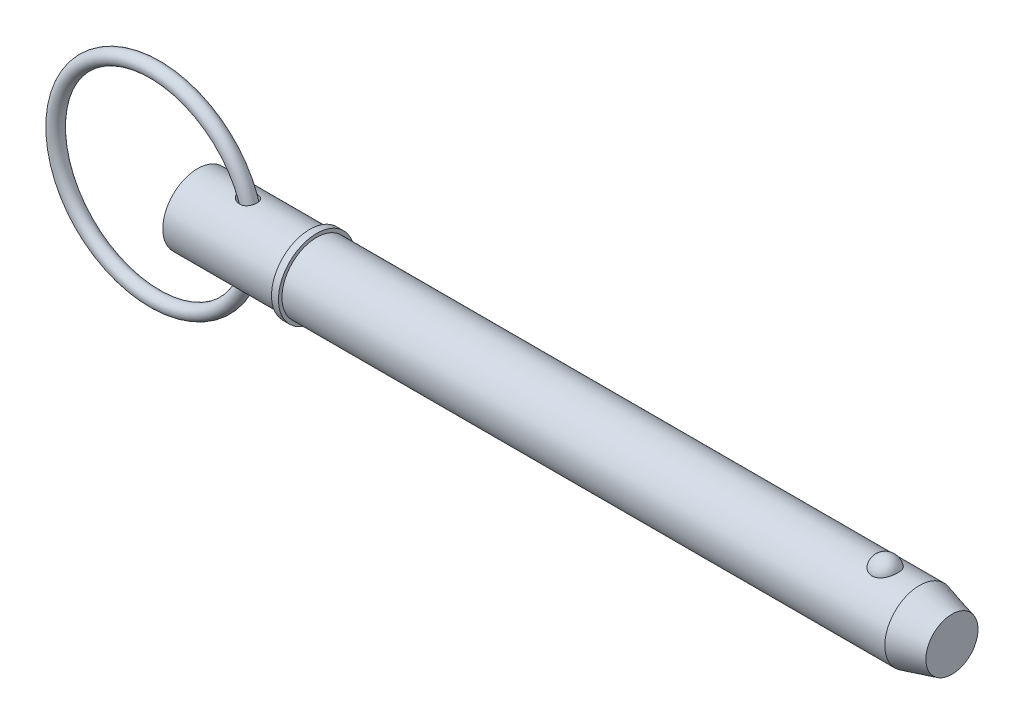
ISO-10303-21;
HEADER;
FILE_DESCRIPTION(('STEP AP214'),'2;1');
FILE_NAME('part.step','',(''),(''),'','','');
FILE_SCHEMA(('AUTOMOTIVE_DESIGN { 1 0 10303 214 1 1 1 1 }'));
ENDSEC;
DATA;
#1=APPLICATION_CONTEXT('core data for automotive mechanical design processes');
#2=APPLICATION_PROTOCOL_DEFINITION('international standard','automotive_design',2000,#1);
#3=PRODUCT_CONTEXT('',#1,'mechanical');
#4=PRODUCT('Part','Part','',(#3));
#5=PRODUCT_RELATED_PRODUCT_CATEGORY('part','',(#4));
#6=PRODUCT_DEFINITION_FORMATION('','',#4);
#7=PRODUCT_DEFINITION_CONTEXT('part definition',#1,'design');
#8=PRODUCT_DEFINITION('design','',#6,#7);
#9=PRODUCT_DEFINITION_SHAPE('','',#8);
#10=(LENGTH_UNIT() NAMED_UNIT(*) SI_UNIT(.MILLI.,.METRE.));
#11=(NAMED_UNIT(*) PLANE_ANGLE_UNIT() SI_UNIT($,.RADIAN.));
#12=(NAMED_UNIT(*) SI_UNIT($,.STERADIAN.) SOLID_ANGLE_UNIT());
#13=UNCERTAINTY_MEASURE_WITH_UNIT(LENGTH_MEASURE(1.E-05),#10,'distance_accuracy_value','');
#14=(GEOMETRIC_REPRESENTATION_CONTEXT(3) GLOBAL_UNCERTAINTY_ASSIGNED_CONTEXT((#13)) GLOBAL_UNIT_ASSIGNED_CONTEXT((#10,
#11,#12)) REPRESENTATION_CONTEXT('',''));
#15=CARTESIAN_POINT('',(0.,0.,0.));
#16=DIRECTION('',(0.,0.,1.));
#17=DIRECTION('',(1.,0.,0.));
#18=AXIS2_PLACEMENT_3D('',#15,#16,#17);
#19=CARTESIAN_POINT('',(-13.640845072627,0.,0.));
#20=DIRECTION('',(0.,0.,1.));
#21=DIRECTION('',(1.,0.,0.));
#22=AXIS2_PLACEMENT_3D('',#19,#20,#21);
#23=TOROIDAL_SURFACE('',#22,31.75,2.223);
#24=CARTESIAN_POINT('',(20.332154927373,0.,0.));
#25=VERTEX_POINT('',#24);
#26=VERTEX_LOOP('',#25);
#27=FACE_BOUND('',#26,.T.);
#28=ADVANCED_FACE('P0_F12',(#27),#23,.T.);
#29=CLOSED_SHELL('',(#28));
#30=MANIFOLD_SOLID_BREP('P0_B1',#29);
#31=CARTESIAN_POINT('',(0.,0.,0.));
#32=DIRECTION('',(1.,0.,0.));
#33=DIRECTION('',(0.,0.,-1.));
#34=AXIS2_PLACEMENT_3D('',#31,#32,#33);
#35=CYLINDRICAL_SURFACE('',#34,11.115);
#36=CARTESIAN_POINT('',(13.5245830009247,11.0328953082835,-1.34849772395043));
#37=CARTESIAN_POINT('',(13.6190616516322,11.0150940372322,-1.49413162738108));
#38=CARTESIAN_POINT('',(13.7272589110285,10.9954577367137,-1.63076546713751));
#39=CARTESIAN_POINT('',(13.9654537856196,10.9550099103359,-1.8834727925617));
#40=CARTESIAN_POINT('',(14.0954990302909,10.9341958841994,-1.99950019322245));
#41=CARTESIAN_POINT('',(14.3718600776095,10.893854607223,-2.20871939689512));
#42=CARTESIAN_POINT('',(14.5180879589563,10.8743212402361,-2.30202655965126));
#43=CARTESIAN_POINT('',(14.8233821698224,10.8385071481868,-2.46515115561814));
#44=CARTESIAN_POINT('',(14.9824448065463,10.8222254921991,-2.53497531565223));
#45=CARTESIAN_POINT('',(15.3233581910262,10.7936101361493,-2.65430007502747));
#46=CARTESIAN_POINT('',(15.5060064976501,10.7817126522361,-2.7016502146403));
#47=CARTESIAN_POINT('',(15.8771124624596,10.7657570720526,-2.76455948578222));
#48=CARTESIAN_POINT('',(16.0655695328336,10.7616981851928,-2.78012182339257));
#49=CARTESIAN_POINT('',(16.4345152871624,10.7624400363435,-2.77724928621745));
#50=CARTESIAN_POINT('',(16.6150121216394,10.7668823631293,-2.76018977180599));
#51=CARTESIAN_POINT('',(16.9695132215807,10.7837407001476,-2.69357457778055));
#52=CARTESIAN_POINT('',(17.1435222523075,10.7961507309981,-2.64404326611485));
#53=CARTESIAN_POINT('',(17.4621418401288,10.8258984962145,-2.51928348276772));
#54=CARTESIAN_POINT('',(17.6079677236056,10.8426430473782,-2.44700611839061));
#55=CARTESIAN_POINT('',(17.884162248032,10.8794194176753,-2.27791740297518));
#56=CARTESIAN_POINT('',(18.0145349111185,10.8994503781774,-2.18111245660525));
#57=CARTESIAN_POINT('',(18.2494965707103,10.9392822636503,-1.9713196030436));
#58=CARTESIAN_POINT('',(18.3550661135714,10.9590421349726,-1.85941863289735));
#59=CARTESIAN_POINT('',(18.5458147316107,10.9970986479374,-1.61919918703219));
#60=CARTESIAN_POINT('',(18.6309947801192,11.0153953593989,-1.49088149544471));
#61=CARTESIAN_POINT('',(18.7786686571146,11.0484675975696,-1.2218388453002));
#62=CARTESIAN_POINT('',(18.8412214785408,11.063252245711,-1.08114735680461));
#63=CARTESIAN_POINT('',(18.9425265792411,11.0877718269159,-0.791025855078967));
#64=CARTESIAN_POINT('',(18.9812780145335,11.0975065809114,-0.641595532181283));
#65=CARTESIAN_POINT('',(19.0343305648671,11.1109435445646,-0.336997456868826));
#66=CARTESIAN_POINT('',(19.0484404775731,11.1145985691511,-0.181794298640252));
#67=CARTESIAN_POINT('',(19.0513147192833,11.1153384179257,0.128864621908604));
#68=CARTESIAN_POINT('',(19.0400783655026,11.112423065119,0.284320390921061));
#69=CARTESIAN_POINT('',(18.9924362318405,11.1003163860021,0.591525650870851));
#70=CARTESIAN_POINT('',(18.9559600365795,11.0911075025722,0.743263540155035));
#71=CARTESIAN_POINT('',(18.858576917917,11.0673920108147,1.0382524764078));
#72=CARTESIAN_POINT('',(18.7976699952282,11.0528854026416,1.18150352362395));
#73=CARTESIAN_POINT('',(18.6529960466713,11.020201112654,1.45511394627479));
#74=CARTESIAN_POINT('',(18.5692772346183,11.0020311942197,1.58549973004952));
#75=CARTESIAN_POINT('',(18.3810003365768,10.9640237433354,1.82995492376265));
#76=CARTESIAN_POINT('',(18.2764441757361,10.9441863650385,1.94402583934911));
#77=CARTESIAN_POINT('',(18.0501398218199,10.9052267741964,2.15183128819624));
#78=CARTESIAN_POINT('',(17.9285270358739,10.8861003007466,2.24571250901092));
#79=CARTESIAN_POINT('',(17.6709592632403,10.8505244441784,2.41175942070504));
#80=CARTESIAN_POINT('',(17.5350055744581,10.8340748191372,2.48392707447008));
#81=CARTESIAN_POINT('',(17.2528390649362,10.8056099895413,2.60497667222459));
#82=CARTESIAN_POINT('',(17.1066353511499,10.7935909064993,2.65387899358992));
#83=CARTESIAN_POINT('',(16.8080326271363,10.7750969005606,2.72799859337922));
#84=CARTESIAN_POINT('',(16.6556326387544,10.7686228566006,2.75321211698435));
#85=CARTESIAN_POINT('',(16.3428877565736,10.761517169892,2.78086153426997));
#86=CARTESIAN_POINT('',(16.1824599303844,10.7611149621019,2.78240297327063));
#87=CARTESIAN_POINT('',(15.863296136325,10.766478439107,2.76156874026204));
#88=CARTESIAN_POINT('',(15.7045607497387,10.7722461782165,2.73918510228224));
#89=CARTESIAN_POINT('',(15.3787211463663,10.7898500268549,2.66904167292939));
#90=CARTESIAN_POINT('',(15.2120794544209,10.8021675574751,2.61925575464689));
#91=CARTESIAN_POINT('',(14.8886284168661,10.8315482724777,2.49496357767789));
#92=CARTESIAN_POINT('',(14.731827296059,10.8486153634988,2.42043695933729));
#93=CARTESIAN_POINT('',(14.4198762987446,10.8870804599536,2.24137362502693));
#94=CARTESIAN_POINT('',(14.2658484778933,10.9087148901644,2.13492229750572));
#95=CARTESIAN_POINT('',(13.9788214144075,10.9526299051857,1.89676517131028));
#96=CARTESIAN_POINT('',(13.8458041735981,10.9749099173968,1.76508120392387));
#97=CARTESIAN_POINT('',(13.6310853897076,11.012885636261,1.50762337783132));
#98=CARTESIAN_POINT('',(13.5444453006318,11.0290026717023,1.38602082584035));
#99=CARTESIAN_POINT('',(13.392158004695,11.0581740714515,1.12983363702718));
#100=CARTESIAN_POINT('',(13.3264946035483,11.0712307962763,0.995259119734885));
#101=CARTESIAN_POINT('',(13.2464179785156,11.0874250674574,0.785640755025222));
#102=CARTESIAN_POINT('',(13.2227369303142,11.0922707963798,0.714166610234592));
#103=CARTESIAN_POINT('',(13.1820656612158,11.1006486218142,0.569277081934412));
#104=CARTESIAN_POINT('',(13.1650721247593,11.1041813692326,0.495862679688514));
#105=CARTESIAN_POINT('',(13.1381118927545,11.1098070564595,0.347711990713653));
#106=CARTESIAN_POINT('',(13.1281436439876,11.1119003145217,0.272975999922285));
#107=CARTESIAN_POINT('',(13.1154243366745,11.1145746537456,0.122890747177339));
#108=CARTESIAN_POINT('',(13.1126723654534,11.1151559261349,0.0475415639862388));
#109=CARTESIAN_POINT('',(13.115160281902,11.1146296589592,-0.160384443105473));
#110=CARTESIAN_POINT('',(13.128061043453,11.111903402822,-0.292944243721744));
#111=CARTESIAN_POINT('',(13.175691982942,11.1019662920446,-0.553751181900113));
#112=CARTESIAN_POINT('',(13.2104121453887,11.094757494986,-0.682000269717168));
#113=CARTESIAN_POINT('',(13.2891255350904,11.0787645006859,-0.901873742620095));
#114=CARTESIAN_POINT('',(13.3290466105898,11.0707438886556,-0.995044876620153));
#115=CARTESIAN_POINT('',(13.4192915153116,11.0529876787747,-1.17599209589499));
#116=CARTESIAN_POINT('',(13.4696154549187,11.0432520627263,-1.26376812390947));
#117=CARTESIAN_POINT('',(13.5245830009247,11.0328953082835,-1.34849772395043));
#118=B_SPLINE_CURVE_WITH_KNOTS('',3,(#36,#37,#38,#39,#40,#41,#42,#43,#44,#45,#46,#47,#48,#49,
#50,#51,#52,#53,#54,#55,#56,#57,#58,#59,#60,#61,#62,#63,#64,#65,#66,#67,#68,#69,#70,#71,#72,#73,
#74,#75,#76,#77,#78,#79,#80,#81,#82,#83,#84,#85,#86,#87,#88,#89,#90,#91,#92,#93,#94,#95,#96,#97,
#98,#99,#100,#101,#102,#103,#104,#105,#106,#107,#108,#109,#110,#111,#112,#113,#114,#115,#116,
#117),.UNSPECIFIED.,.T.,.F.,(4,2,2,2,2,2,2,2,2,2,2,2,2,2,2,2,2,2,2,2,2,2,2,2,2,2,2,2,2,2,2,2,2,
2,2,2,2,2,2,2,4),(0.,0.52309976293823,1.04735506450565,1.56889024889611,2.09027590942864,
2.65465173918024,3.21897064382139,3.76002078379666,4.30066536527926,4.78898318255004,
5.27717362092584,5.74028268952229,6.20336964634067,6.665240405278,7.12712754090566,
7.59258295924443,8.05805091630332,8.52482272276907,8.99159451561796,9.45738731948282,
9.9231371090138,10.3853792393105,10.8475795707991,11.3093743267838,11.7712422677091,
12.2505208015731,12.7299589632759,13.2508366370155,13.7721440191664,14.334890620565,
14.8971525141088,15.3459336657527,15.7943675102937,16.0204422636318,16.2464047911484,
16.4723173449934,16.6982013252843,17.095711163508,17.4930386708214,17.7973741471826,
18.1017128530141),.UNSPECIFIED.);
#119=CARTESIAN_POINT('',(13.5245830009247,11.0328953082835,-1.34849772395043));
#120=VERTEX_POINT('',#119);
#121=EDGE_CURVE('P1_E42',#120,#120,#118,.T.);
#122=ORIENTED_EDGE('',*,*,#121,.T.);
#123=EDGE_LOOP('',(#122));
#124=FACE_BOUND('',#123,.T.);
#125=CARTESIAN_POINT('',(0.,0.,0.));
#126=DIRECTION('',(1.,0.,0.));
#127=DIRECTION('',(0.,0.,-1.));
#128=AXIS2_PLACEMENT_3D('',#125,#126,#127);
#129=CIRCLE('',#128,11.115);
#130=CARTESIAN_POINT('',(0.,0.,-11.115));
#131=VERTEX_POINT('',#130);
#132=EDGE_CURVE('P1_E9',#131,#131,#129,.T.);
#133=ORIENTED_EDGE('',*,*,#132,.T.);
#134=EDGE_LOOP('',(#133));
#135=FACE_BOUND('',#134,.T.);
#136=CARTESIAN_POINT('',(35.877,0.,0.));
#137=DIRECTION('',(1.,0.,0.));
#138=DIRECTION('',(0.,0.,-1.));
#139=AXIS2_PLACEMENT_3D('',#136,#137,#138);
#140=CIRCLE('',#139,11.115);
#141=CARTESIAN_POINT('',(35.877,0.,-11.115));
#142=VERTEX_POINT('',#141);
#143=EDGE_CURVE('P1_E25',#142,#142,#140,.T.);
#144=ORIENTED_EDGE('',*,*,#143,.F.);
#145=EDGE_LOOP('',(#144));
#146=FACE_BOUND('',#145,.T.);
#147=CARTESIAN_POINT('',(13.5245830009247,-11.0328953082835,-1.34849772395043));
#148=CARTESIAN_POINT('',(13.449887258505,-11.0469690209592,-1.233356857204));
#149=CARTESIAN_POINT('',(13.3837464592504,-11.0598986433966,-1.11255897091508));
#150=CARTESIAN_POINT('',(13.271526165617,-11.0822620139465,-0.861680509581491));
#151=CARTESIAN_POINT('',(13.2254273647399,-11.0916991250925,-0.731609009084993));
#152=CARTESIAN_POINT('',(13.1557497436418,-11.1060943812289,-0.464578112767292));
#153=CARTESIAN_POINT('',(13.1322820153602,-11.111030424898,-0.327588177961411));
#154=CARTESIAN_POINT('',(13.1098958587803,-11.1157368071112,-0.0515139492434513));
#155=CARTESIAN_POINT('',(13.1109730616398,-11.1155080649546,0.0875699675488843));
#156=CARTESIAN_POINT('',(13.1367722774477,-11.110088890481,0.354927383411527));
#157=CARTESIAN_POINT('',(13.160070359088,-11.1051972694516,0.483348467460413));
#158=CARTESIAN_POINT('',(13.2268311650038,-11.091413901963,0.734581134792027));
#159=CARTESIAN_POINT('',(13.2702981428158,-11.0825213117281,0.857391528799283));
#160=CARTESIAN_POINT('',(13.3769008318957,-11.0612491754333,1.09871322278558));
#161=CARTESIAN_POINT('',(13.4406446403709,-11.048763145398,1.21694419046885));
#162=CARTESIAN_POINT('',(13.5844860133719,-11.0215642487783,1.44267020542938));
#163=CARTESIAN_POINT('',(13.6645903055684,-11.0068504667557,1.55016080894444));
#164=CARTESIAN_POINT('',(13.8511803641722,-10.9741237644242,1.76795565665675));
#165=CARTESIAN_POINT('',(13.959808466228,-10.9559422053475,1.87639683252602));
#166=CARTESIAN_POINT('',(14.1916437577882,-10.9197998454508,2.07642617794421));
#167=CARTESIAN_POINT('',(14.3148607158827,-10.901839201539,2.16800294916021));
#168=CARTESIAN_POINT('',(14.5931107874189,-10.8649902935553,2.34622033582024));
#169=CARTESIAN_POINT('',(14.7501095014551,-10.8463937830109,2.42986679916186));
#170=CARTESIAN_POINT('',(15.0757118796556,-10.8136392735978,2.57171975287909));
#171=CARTESIAN_POINT('',(15.2443214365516,-10.7994835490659,2.62991321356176));
#172=CARTESIAN_POINT('',(15.599068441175,-10.7767894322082,2.72147498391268));
#173=CARTESIAN_POINT('',(15.7856559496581,-10.768622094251,2.75321798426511));
#174=CARTESIAN_POINT('',(16.1617095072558,-10.7608206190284,2.78356776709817));
#175=CARTESIAN_POINT('',(16.3511739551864,-10.7611818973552,2.78219235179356));
#176=CARTESIAN_POINT('',(16.7138126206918,-10.7705428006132,2.7457129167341));
#177=CARTESIAN_POINT('',(16.8872269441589,-10.7789612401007,2.71287798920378));
#178=CARTESIAN_POINT('',(17.2247245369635,-10.8028011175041,2.61632772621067));
#179=CARTESIAN_POINT('',(17.3888134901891,-10.8182182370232,2.55263143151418));
#180=CARTESIAN_POINT('',(17.6871641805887,-10.8524191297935,2.40281428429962));
#181=CARTESIAN_POINT('',(17.8227812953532,-10.8707652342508,2.31928155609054));
#182=CARTESIAN_POINT('',(18.0770765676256,-10.9094513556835,2.12988301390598));
#183=CARTESIAN_POINT('',(18.1957578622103,-10.9297910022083,2.0240213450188));
#184=CARTESIAN_POINT('',(18.4088055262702,-10.9693230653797,1.79719870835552));
#185=CARTESIAN_POINT('',(18.5038890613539,-10.9885305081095,1.67691225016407));
#186=CARTESIAN_POINT('',(18.6726701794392,-11.0244347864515,1.42183894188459));
#187=CARTESIAN_POINT('',(18.7463681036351,-11.0411316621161,1.28705232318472));
#188=CARTESIAN_POINT('',(18.8708297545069,-11.0702507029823,1.00634471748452));
#189=CARTESIAN_POINT('',(18.9215212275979,-11.0826593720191,0.860390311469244));
#190=CARTESIAN_POINT('',(18.9984973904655,-11.1017993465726,0.561823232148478));
#191=CARTESIAN_POINT('',(19.0247811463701,-11.1085304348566,0.409210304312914));
#192=CARTESIAN_POINT('',(19.0524622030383,-11.1156244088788,0.100537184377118));
#193=CARTESIAN_POINT('',(19.0536873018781,-11.1159432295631,-0.0555394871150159));
#194=CARTESIAN_POINT('',(19.0307837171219,-11.110065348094,-0.365700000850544));
#195=CARTESIAN_POINT('',(19.0066544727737,-11.1038685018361,-0.519783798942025));
#196=CARTESIAN_POINT('',(18.9335163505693,-11.0856111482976,-0.821817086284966));
#197=CARTESIAN_POINT('',(18.88447016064,-11.0735418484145,-0.969757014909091));
#198=CARTESIAN_POINT('',(18.7625929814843,-11.0448501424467,-1.25502066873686));
#199=CARTESIAN_POINT('',(18.6897623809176,-11.0282278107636,-1.39234456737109));
#200=CARTESIAN_POINT('',(18.522359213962,-10.9923333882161,-1.65195905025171));
#201=CARTESIAN_POINT('',(18.427863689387,-10.9730707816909,-1.77430060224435));
#202=CARTESIAN_POINT('',(18.2194216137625,-10.9340072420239,-2.00099176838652));
#203=CARTESIAN_POINT('',(18.1054772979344,-10.9142063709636,-2.10534344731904));
#204=CARTESIAN_POINT('',(17.8622613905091,-10.8764452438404,-2.2924289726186));
#205=CARTESIAN_POINT('',(17.7331196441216,-10.8584715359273,-2.3753290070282));
#206=CARTESIAN_POINT('',(17.4625069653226,-10.8261386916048,-2.51860389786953));
#207=CARTESIAN_POINT('',(17.3210365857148,-10.8117793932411,-2.57897976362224));
#208=CARTESIAN_POINT('',(17.0290309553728,-10.7880576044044,-2.67648805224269));
#209=CARTESIAN_POINT('',(16.8784484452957,-10.7787241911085,-2.71348542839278));
#210=CARTESIAN_POINT('',(16.573148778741,-10.7659618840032,-2.7636855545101));
#211=CARTESIAN_POINT('',(16.4184306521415,-10.7625343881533,-2.77688267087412));
#212=CARTESIAN_POINT('',(16.1008073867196,-10.761643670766,-2.78033419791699));
#213=CARTESIAN_POINT('',(15.9378898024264,-10.7644957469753,-2.76937572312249));
#214=CARTESIAN_POINT('',(15.6157286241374,-10.7762062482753,-2.72344300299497));
#215=CARTESIAN_POINT('',(15.4564861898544,-10.7850665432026,-2.68846128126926));
#216=CARTESIAN_POINT('',(15.1305734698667,-10.808737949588,-2.59174021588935));
#217=CARTESIAN_POINT('',(14.9645834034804,-10.8240246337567,-2.52782071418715));
#218=CARTESIAN_POINT('',(14.6448218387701,-10.8585969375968,-2.37491543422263));
#219=CARTESIAN_POINT('',(14.4910653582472,-10.8778873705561,-2.28589943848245));
#220=CARTESIAN_POINT('',(14.1837929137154,-10.920550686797,-2.07312951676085));
#221=CARTESIAN_POINT('',(14.0321999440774,-10.9441390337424,-1.94661563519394));
#222=CARTESIAN_POINT('',(13.756115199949,-10.9902311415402,-1.66673537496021));
#223=CARTESIAN_POINT('',(13.6315733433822,-11.0127368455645,-1.51341958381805));
#224=CARTESIAN_POINT('',(13.5245830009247,-11.0328953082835,-1.34849772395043));
#225=B_SPLINE_CURVE_WITH_KNOTS('',3,(#147,#148,#149,#150,#151,#152,#153,#154,#155,#156,#157,
#158,#159,#160,#161,#162,#163,#164,#165,#166,#167,#168,#169,#170,#171,#172,#173,#174,#175,#176,
#177,#178,#179,#180,#181,#182,#183,#184,#185,#186,#187,#188,#189,#190,#191,#192,#193,#194,#195,
#196,#197,#198,#199,#200,#201,#202,#203,#204,#205,#206,#207,#208,#209,#210,#211,#212,#213,#214,
#215,#216,#217,#218,#219,#220,#221,#222,#223,#224),.UNSPECIFIED.,.T.,.F.,(4,2,2,2,2,2,2,2,2,2,2,
2,2,2,2,2,2,2,2,2,2,2,2,2,2,2,2,2,2,2,2,2,2,2,2,2,2,2,4),(0.,0.4133945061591,0.8263899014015,
1.24140245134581,1.65634113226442,2.04635967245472,2.43646050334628,2.83958259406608,
3.24287078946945,3.70479277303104,4.16702582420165,4.70130512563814,5.23585761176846,
5.80123945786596,6.36631739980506,6.89348344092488,7.42032464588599,7.8989135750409,
8.37741373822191,8.83881993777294,9.30021877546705,9.76305681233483,10.2259125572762,
10.6919479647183,11.1579936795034,11.6247393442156,12.0914773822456,12.55658073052,
13.0216306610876,13.4829619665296,13.9442725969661,14.408224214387,14.8722856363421,
15.3601762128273,15.8482186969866,16.3815107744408,16.9154477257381,17.5086806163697,
18.1008056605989),.UNSPECIFIED.);
#226=CARTESIAN_POINT('',(13.5245830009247,-11.0328953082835,-1.34849772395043));
#227=VERTEX_POINT('',#226);
#228=EDGE_CURVE('P1_E17',#227,#227,#225,.T.);
#229=ORIENTED_EDGE('',*,*,#228,.T.);
#230=EDGE_LOOP('',(#229));
#231=FACE_BOUND('',#230,.T.);
#232=ADVANCED_FACE('P1_F13',(#124,#135,#146,#231),#35,.T.);
#233=CARTESIAN_POINT('',(0.,0.,0.));
#234=DIRECTION('',(1.,0.,0.));
#235=DIRECTION('',(0.,0.,-1.));
#236=AXIS2_PLACEMENT_3D('',#233,#234,#235);
#237=CYLINDRICAL_SURFACE('',#236,11.115);
#238=CARTESIAN_POINT('',(230.929563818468,0.,0.));
#239=DIRECTION('',(1.,0.,0.));
#240=DIRECTION('',(0.,0.,-1.));
#241=AXIS2_PLACEMENT_3D('',#238,#239,#240);
#242=CIRCLE('',#241,11.115);
#243=CARTESIAN_POINT('',(230.929563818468,0.,-11.115));
#244=VERTEX_POINT('',#243);
#245=EDGE_CURVE('P1_E99',#244,#244,#242,.T.);
#246=ORIENTED_EDGE('',*,*,#245,.F.);
#247=EDGE_LOOP('',(#246));
#248=FACE_BOUND('',#247,.T.);
#249=CARTESIAN_POINT('',(38.1,0.,0.));
#250=DIRECTION('',(1.,0.,0.));
#251=DIRECTION('',(0.,0.,-1.));
#252=AXIS2_PLACEMENT_3D('',#249,#250,#251);
#253=CIRCLE('',#252,11.115);
#254=CARTESIAN_POINT('',(38.1,0.,-11.115));
#255=VERTEX_POINT('',#254);
#256=EDGE_CURVE('P1_E96',#255,#255,#253,.T.);
#257=ORIENTED_EDGE('',*,*,#256,.T.);
#258=EDGE_LOOP('',(#257));
#259=FACE_BOUND('',#258,.T.);
#260=CARTESIAN_POINT('',(219.931068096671,10.3028087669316,4.17077409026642));
#261=CARTESIAN_POINT('',(219.714775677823,10.3028003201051,4.17078240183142));
#262=CARTESIAN_POINT('',(219.498548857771,10.3098895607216,4.1534059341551));
#263=CARTESIAN_POINT('',(219.072540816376,10.3373834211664,4.08449540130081));
#264=CARTESIAN_POINT('',(218.862757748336,10.3577841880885,4.03297121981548));
#265=CARTESIAN_POINT('',(218.455782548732,10.4095237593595,3.89746513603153));
#266=CARTESIAN_POINT('',(218.258572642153,10.4408466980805,3.81353029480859));
#267=CARTESIAN_POINT('',(217.881338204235,10.5110236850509,3.61560339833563));
#268=CARTESIAN_POINT('',(217.701317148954,10.5498792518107,3.50160528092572));
#269=CARTESIAN_POINT('',(217.357684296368,10.6322884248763,3.2429246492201));
#270=CARTESIAN_POINT('',(217.194686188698,10.6759443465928,3.09746040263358));
#271=CARTESIAN_POINT('',(216.894591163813,10.7625291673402,2.78171925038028));
#272=CARTESIAN_POINT('',(216.757499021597,10.8054579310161,2.61143778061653));
#273=CARTESIAN_POINT('',(216.506408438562,10.8881935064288,2.24226695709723));
#274=CARTESIAN_POINT('',(216.393710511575,10.9277761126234,2.04244123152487));
#275=CARTESIAN_POINT('',(216.201777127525,10.997484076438,1.62578254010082));
#276=CARTESIAN_POINT('',(216.122544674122,11.0276085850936,1.40894804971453));
#277=CARTESIAN_POINT('',(215.998303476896,11.0756732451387,0.961250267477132));
#278=CARTESIAN_POINT('',(215.953760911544,11.0934470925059,0.730239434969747));
#279=CARTESIAN_POINT('',(215.901569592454,11.1143331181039,0.263439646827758));
#280=CARTESIAN_POINT('',(215.893920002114,11.1174456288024,0.0276507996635));
#281=CARTESIAN_POINT('',(215.91561056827,11.1087161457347,-0.440729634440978));
#282=CARTESIAN_POINT('',(215.944762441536,11.0969502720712,-0.673331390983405));
#283=CARTESIAN_POINT('',(216.039143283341,11.0597872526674,-1.12996621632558));
#284=CARTESIAN_POINT('',(216.104372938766,11.0343898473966,-1.35399912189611));
#285=CARTESIAN_POINT('',(216.26969844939,10.972515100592,-1.78750286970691));
#286=CARTESIAN_POINT('',(216.36983863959,10.9360236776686,-1.99695478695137));
#287=CARTESIAN_POINT('',(216.602940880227,10.855759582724,-2.39520667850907));
#288=CARTESIAN_POINT('',(216.735905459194,10.8119863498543,-2.58400506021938));
#289=CARTESIAN_POINT('',(217.032407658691,10.7216733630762,-2.93635726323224));
#290=CARTESIAN_POINT('',(217.196056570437,10.675123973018,-3.09981510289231));
#291=CARTESIAN_POINT('',(217.549860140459,10.5846571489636,-3.3959224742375));
#292=CARTESIAN_POINT('',(217.740012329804,10.5407394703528,-3.52857487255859));
#293=CARTESIAN_POINT('',(218.13750141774,10.4616690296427,-3.7564605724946));
#294=CARTESIAN_POINT('',(218.34436705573,10.4263443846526,-3.85245432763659));
#295=CARTESIAN_POINT('',(218.772954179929,10.3675574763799,-4.00798747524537));
#296=CARTESIAN_POINT('',(218.994670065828,10.344090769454,-4.06754052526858));
#297=CARTESIAN_POINT('',(219.434669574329,10.3128282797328,-4.14614314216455));
#298=CARTESIAN_POINT('',(219.652565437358,10.3043040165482,-4.16707833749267));
#299=CARTESIAN_POINT('',(220.08894951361,10.3016771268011,-4.17357158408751));
#300=CARTESIAN_POINT('',(220.307437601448,10.3075716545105,-4.159136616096));
#301=CARTESIAN_POINT('',(220.731744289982,10.3326686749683,-4.0963696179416));
#302=CARTESIAN_POINT('',(220.937745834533,10.3514555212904,-4.04909574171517));
#303=CARTESIAN_POINT('',(221.338576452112,10.399818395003,-3.92320197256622));
#304=CARTESIAN_POINT('',(221.5334046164,10.4293952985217,-3.84457953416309));
#305=CARTESIAN_POINT('',(221.911191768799,10.4969600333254,-3.6561241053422));
#306=CARTESIAN_POINT('',(222.093797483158,10.5351178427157,-3.54564545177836));
#307=CARTESIAN_POINT('',(222.438204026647,10.6154999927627,-3.29718036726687));
#308=CARTESIAN_POINT('',(222.600000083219,10.657725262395,-3.1591876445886));
#309=CARTESIAN_POINT('',(222.906959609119,10.744212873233,-2.85163580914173));
#310=CARTESIAN_POINT('',(223.050891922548,10.7884718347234,-2.68084605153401));
#311=CARTESIAN_POINT('',(223.309237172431,10.872374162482,-2.3172186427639));
#312=CARTESIAN_POINT('',(223.423644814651,10.9120167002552,-2.12437704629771));
#313=CARTESIAN_POINT('',(223.623873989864,10.9838919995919,-1.71516999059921));
#314=CARTESIAN_POINT('',(223.70866178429,11.0158465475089,-1.498248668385));
#315=CARTESIAN_POINT('',(223.84268382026,11.0673523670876,-1.052285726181));
#316=CARTESIAN_POINT('',(223.891917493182,11.086903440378,-0.823243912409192));
#317=CARTESIAN_POINT('',(223.953891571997,11.1116323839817,-0.359087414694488));
#318=CARTESIAN_POINT('',(223.966566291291,11.1167843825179,-0.123962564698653));
#319=CARTESIAN_POINT('',(223.954973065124,11.1121144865,0.34522049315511));
#320=CARTESIAN_POINT('',(223.930705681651,11.1022928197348,0.579278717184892));
#321=CARTESIAN_POINT('',(223.845907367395,11.0687504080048,1.03866534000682));
#322=CARTESIAN_POINT('',(223.785529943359,11.0450885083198,1.26402641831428));
#323=CARTESIAN_POINT('',(223.629853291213,10.9863185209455,1.70076772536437));
#324=CARTESIAN_POINT('',(223.534551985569,10.9512097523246,1.91214712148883));
#325=CARTESIAN_POINT('',(223.310397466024,10.8729733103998,2.31608359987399));
#326=CARTESIAN_POINT('',(223.181380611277,10.8298068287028,2.50854240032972));
#327=CARTESIAN_POINT('',(222.892732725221,10.7401896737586,2.86808766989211));
#328=CARTESIAN_POINT('',(222.733102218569,10.6937390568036,3.03517457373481));
#329=CARTESIAN_POINT('',(222.387534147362,10.6029321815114,3.33857581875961));
#330=CARTESIAN_POINT('',(222.201708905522,10.5585680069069,3.47501541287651));
#331=CARTESIAN_POINT('',(221.807875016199,10.4769321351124,3.71390897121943));
#332=CARTESIAN_POINT('',(221.599863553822,10.439661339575,3.81635861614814));
#333=CARTESIAN_POINT('',(221.154066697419,10.3749407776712,3.98910631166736));
#334=CARTESIAN_POINT('',(220.915234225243,10.3482457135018,4.05700929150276));
#335=CARTESIAN_POINT('',(220.427925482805,10.312188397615,4.14782844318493));
#336=CARTESIAN_POINT('',(220.179453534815,10.3028184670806,4.1707645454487));
#337=CARTESIAN_POINT('',(219.931068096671,10.3028087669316,4.17077409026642));
#338=B_SPLINE_CURVE_WITH_KNOTS('',3,(#260,#261,#262,#263,#264,#265,#266,#267,#268,#269,#270,
#271,#272,#273,#274,#275,#276,#277,#278,#279,#280,#281,#282,#283,#284,#285,#286,#287,#288,#289,
#290,#291,#292,#293,#294,#295,#296,#297,#298,#299,#300,#301,#302,#303,#304,#305,#306,#307,#308,
#309,#310,#311,#312,#313,#314,#315,#316,#317,#318,#319,#320,#321,#322,#323,#324,#325,#326,#327,
#328,#329,#330,#331,#332,#333,#334,#335,#336,#337),.UNSPECIFIED.,.T.,.F.,(4,2,2,2,2,2,2,2,2,2,2,
2,2,2,2,2,2,2,2,2,2,2,2,2,2,2,2,2,2,2,2,2,2,2,2,2,2,2,4),(0.,0.647966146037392,1.29574482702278,
1.9425864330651,2.58955857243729,3.25496465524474,3.9204932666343,4.6156636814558,
5.31089647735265,6.01531821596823,6.71972398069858,7.42054043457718,8.12137023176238,
8.82309331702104,9.52487047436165,10.2292439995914,10.9335519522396,11.6223330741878,
12.31085589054,12.96476640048,13.618547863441,14.2521847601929,14.8858731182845,
15.5334360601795,16.1811472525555,16.8611459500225,17.5412664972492,18.2431855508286,
18.9451158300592,19.6483065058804,20.3514864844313,21.0516982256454,21.7519516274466,
22.4556690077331,23.1593743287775,23.8601491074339,24.561012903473,25.3054529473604,
26.0495629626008),.UNSPECIFIED.);
#339=CARTESIAN_POINT('',(219.931068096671,10.3028087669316,4.17077409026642));
#340=VERTEX_POINT('',#339);
#341=EDGE_CURVE('P1_E34',#340,#340,#338,.T.);
#342=ORIENTED_EDGE('',*,*,#341,.T.);
#343=EDGE_LOOP('',(#342));
#344=FACE_BOUND('',#343,.T.);
#345=ADVANCED_FACE('P1_F46',(#248,#259,#344),#237,.T.);
#346=CARTESIAN_POINT('',(0.,0.,0.));
#347=DIRECTION('',(-1.,0.,0.));
#348=DIRECTION('',(0.,0.,1.));
#349=AXIS2_PLACEMENT_3D('',#346,#347,#348);
#350=PLANE('',#349);
#351=ORIENTED_EDGE('',*,*,#132,.F.);
#352=EDGE_LOOP('',(#351));
#353=FACE_BOUND('',#352,.T.);
#354=ADVANCED_FACE('P1_F15',(#353),#350,.T.);
#355=CARTESIAN_POINT('',(35.877,11.115,0.));
#356=DIRECTION('',(-1.,0.,0.));
#357=DIRECTION('',(0.,0.,1.));
#358=AXIS2_PLACEMENT_3D('',#355,#356,#357);
#359=PLANE('',#358);
#360=ORIENTED_EDGE('',*,*,#143,.T.);
#361=EDGE_LOOP('',(#360));
#362=FACE_BOUND('',#361,.T.);
#363=CARTESIAN_POINT('',(35.877,0.,0.));
#364=DIRECTION('',(1.,0.,0.));
#365=DIRECTION('',(0.,0.,-1.));
#366=AXIS2_PLACEMENT_3D('',#363,#364,#365);
#367=CIRCLE('',#366,12.2265);
#368=CARTESIAN_POINT('',(35.877,0.,-12.2265));
#369=VERTEX_POINT('',#368);
#370=EDGE_CURVE('P1_E30',#369,#369,#367,.T.);
#371=ORIENTED_EDGE('',*,*,#370,.F.);
#372=EDGE_LOOP('',(#371));
#373=FACE_BOUND('',#372,.T.);
#374=ADVANCED_FACE('P1_F81',(#362,#373),#359,.T.);
#375=CARTESIAN_POINT('',(0.,0.,0.));
#376=DIRECTION('',(1.,0.,0.));
#377=DIRECTION('',(0.,0.,-1.));
#378=AXIS2_PLACEMENT_3D('',#375,#376,#377);
#379=CYLINDRICAL_SURFACE('',#378,12.2265);
#380=ORIENTED_EDGE('',*,*,#370,.T.);
#381=EDGE_LOOP('',(#380));
#382=FACE_BOUND('',#381,.T.);
#383=CARTESIAN_POINT('',(38.1,0.,0.));
#384=DIRECTION('',(1.,0.,0.));
#385=DIRECTION('',(0.,0.,-1.));
#386=AXIS2_PLACEMENT_3D('',#383,#384,#385);
#387=CIRCLE('',#386,12.2265);
#388=CARTESIAN_POINT('',(38.1,0.,-12.2265));
#389=VERTEX_POINT('',#388);
#390=EDGE_CURVE('P1_E95',#389,#389,#387,.T.);
#391=ORIENTED_EDGE('',*,*,#390,.F.);
#392=EDGE_LOOP('',(#391));
#393=FACE_BOUND('',#392,.T.);
#394=ADVANCED_FACE('P1_F68',(#382,#393),#379,.T.);
#395=CARTESIAN_POINT('',(38.1,12.2265,0.));
#396=DIRECTION('',(1.,0.,0.));
#397=DIRECTION('',(0.,0.,-1.));
#398=AXIS2_PLACEMENT_3D('',#395,#396,#397);
#399=PLANE('',#398);
#400=ORIENTED_EDGE('',*,*,#390,.T.);
#401=EDGE_LOOP('',(#400));
#402=FACE_BOUND('',#401,.T.);
#403=ORIENTED_EDGE('',*,*,#256,.F.);
#404=EDGE_LOOP('',(#403));
#405=FACE_BOUND('',#404,.T.);
#406=ADVANCED_FACE('P1_F62',(#402,#405),#399,.T.);
#407=CARTESIAN_POINT('',(241.3,0.,0.));
#408=DIRECTION('',(-1.,0.,0.));
#409=DIRECTION('',(0.,0.,1.));
#410=AXIS2_PLACEMENT_3D('',#407,#408,#409);
#411=CONICAL_SURFACE('',#410,8.33625000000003,0.261799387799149);
#412=ORIENTED_EDGE('',*,*,#245,.T.);
#413=EDGE_LOOP('',(#412));
#414=FACE_BOUND('',#413,.T.);
#415=CARTESIAN_POINT('',(241.3,0.,0.));
#416=DIRECTION('',(1.,0.,0.));
#417=DIRECTION('',(0.,0.,-1.));
#418=AXIS2_PLACEMENT_3D('',#415,#416,#417);
#419=CIRCLE('',#418,8.33625000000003);
#420=CARTESIAN_POINT('',(241.3,0.,-8.33625000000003));
#421=VERTEX_POINT('',#420);
#422=EDGE_CURVE('P1_E41',#421,#421,#419,.T.);
#423=ORIENTED_EDGE('',*,*,#422,.F.);
#424=EDGE_LOOP('',(#423));
#425=FACE_BOUND('',#424,.T.);
#426=ADVANCED_FACE('P1_F59',(#414,#425),#411,.T.);
#427=CARTESIAN_POINT('',(241.3,8.33625000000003,0.));
#428=DIRECTION('',(1.,0.,0.));
#429=DIRECTION('',(0.,0.,-1.));
#430=AXIS2_PLACEMENT_3D('',#427,#428,#429);
#431=PLANE('',#430);
#432=ORIENTED_EDGE('',*,*,#422,.T.);
#433=EDGE_LOOP('',(#432));
#434=FACE_BOUND('',#433,.T.);
#435=ADVANCED_FACE('P1_F55',(#434),#431,.T.);
#436=CARTESIAN_POINT('',(219.931068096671,10.0035,0.));
#437=DIRECTION('',(-1.,0.,0.));
#438=DIRECTION('',(0.,1.,0.));
#439=AXIS2_PLACEMENT_3D('',#436,#437,#438);
#440=SPHERICAL_SURFACE('',#439,4.18149999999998);
#441=ORIENTED_EDGE('',*,*,#341,.F.);
#442=EDGE_LOOP('',(#441));
#443=FACE_BOUND('',#442,.T.);
#444=ADVANCED_FACE('P1_F50',(#443),#440,.T.);
#445=CARTESIAN_POINT('',(-13.640845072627,0.,0.));
#446=DIRECTION('',(0.,0.,1.));
#447=DIRECTION('',(1.,0.,0.));
#448=AXIS2_PLACEMENT_3D('',#445,#446,#447);
#449=TOROIDAL_SURFACE('',#448,31.75,2.77875);
#450=ORIENTED_EDGE('',*,*,#228,.F.);
#451=EDGE_LOOP('',(#450));
#452=FACE_BOUND('',#451,.T.);
#453=ORIENTED_EDGE('',*,*,#121,.F.);
#454=EDGE_LOOP('',(#453));
#455=FACE_BOUND('',#454,.T.);
#456=ADVANCED_FACE('P1_F54',(#452,#455),#449,.F.);
#457=CLOSED_SHELL('',(#232,#345,#354,#374,#394,#406,#426,#435,#444,#456));
#458=MANIFOLD_SOLID_BREP('P1_B1',#457);
#459=ADVANCED_BREP_SHAPE_REPRESENTATION('',(#18,#30,#458),#14);
#460=SHAPE_DEFINITION_REPRESENTATION(#9,#459);
ENDSEC;
END-ISO-10303-21;
